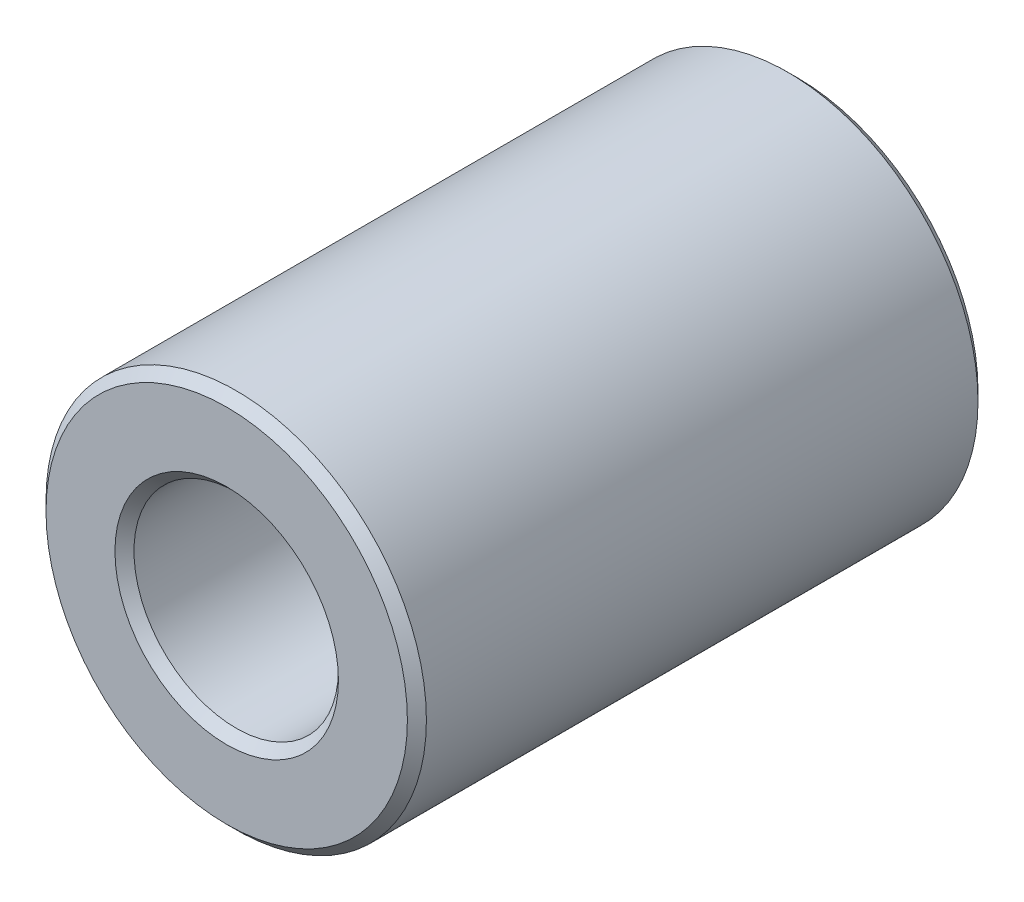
from build123d import *

# Parameters (mm, degrees)
SKETCH1_R           = 4
SKETCH1_R_2         = 2.15
BOSS_EXTRUDE2_DEPTH = 6
CHAMFER3_SIZE       = 0.2


with BuildPart() as part:
    # Sketch1 → Boss-Extrude2 (new, symmetric)
    with BuildSketch(Plane.XY):
        Circle(SKETCH1_R)
        Circle(SKETCH1_R_2, mode=Mode.SUBTRACT)
    extrude(amount=BOSS_EXTRUDE2_DEPTH, both=True)

    # Chamfer3
    chamfer3_edges = [part.edges().sort_by_distance(p)[0] for p in [
        (-4, 0, -6),
        (-4, 0, 6),
        (-2.15, 0, -6),
        (-2.15, 0, 6),
    ]]
    chamfer(chamfer3_edges, length=CHAMFER3_SIZE)


solid = part.part
